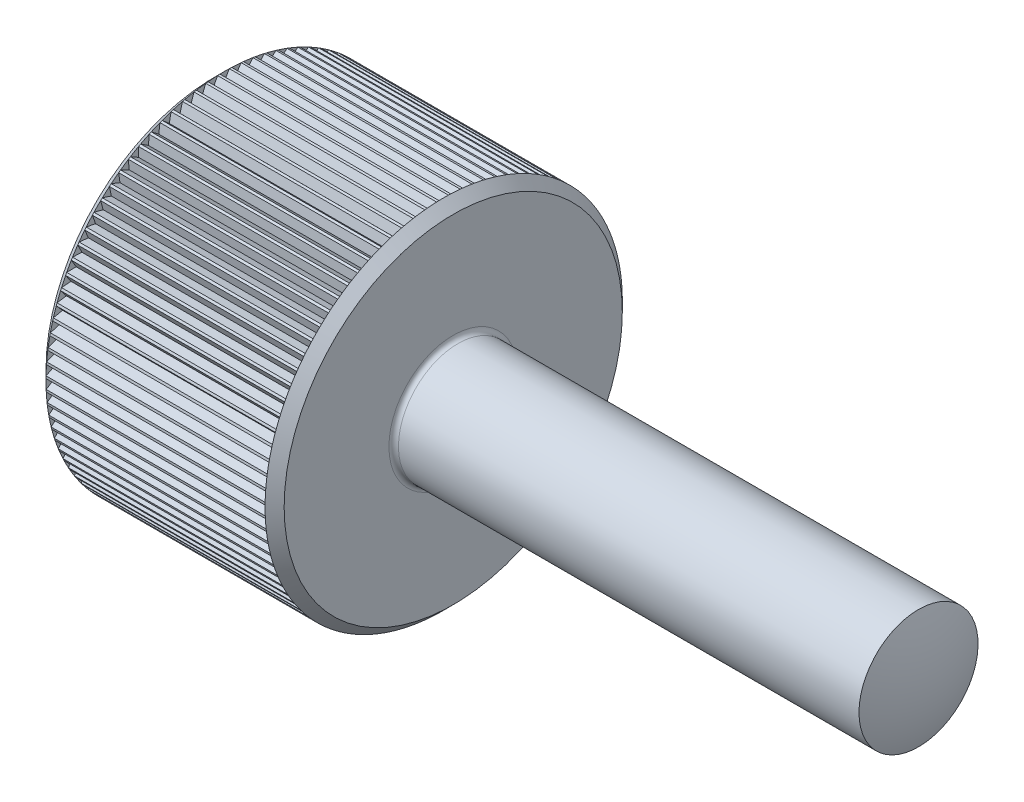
from build123d import *

# Parameters (mm, degrees)
CHAMFER1_SIZE           = 0.8
CUT_EXTRUDE1_DEPTH      = 18.4
CIRCULAR_PATTERN1_COUNT = 95
FILLET1_R               = 0.4


with BuildPart() as part:
    # Sketch1 → Base (revolve)
    with BuildSketch(Plane.XY, mode=Mode.PRIVATE) as base_sk:
        with BuildLine():
            Line((0, 0), (0, 15))
            Line((0, 15), (20, 15))
            Line((20, 15), (20, 5))
            Line((20, 5), (59.076696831, 5))
            ThreePointArc((59.076696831, 5), (59.767239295, 2.542267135), (60, 0))
            Line((60, 0), (0, 0))
        make_face()
    revolve(base_sk.sketch.rotate(Axis((-48.211075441, 0, 0), (1, 0, 0)), 90), axis=Axis((-48.211075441, 0, 0), (1, 0, 0)))

    # Chamfer1
    chamfer1_edges = [part.edges().sort_by_distance(p)[0] for p in [
        (0, 0, -15),
        (20, 0, -15),
    ]]
    chamfer(chamfer1_edges, length=CHAMFER1_SIZE)

    # Sketch3 → Cut-Extrude1 (cut)
    with BuildSketch(Plane(origin=(19.2, 0, 0), x_dir=(0, 0, -1), z_dir=(1, 0, 0))):
        Polygon((0, 14.307179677), (0.6, 15.346410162), (-0.6, 15.346410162), align=None)
    cut_extrude1 = extrude(amount=-CUT_EXTRUDE1_DEPTH, mode=Mode.SUBTRACT)

    # Circular-Pattern1: Cut-Extrude1 ×95 about axis
    circular_pattern1_axis = Axis((0, 0, 0), (1, 0, 0))
    for i in range(1, CIRCULAR_PATTERN1_COUNT):
        add(cut_extrude1.rotate(circular_pattern1_axis, i * 360 / CIRCULAR_PATTERN1_COUNT), mode=Mode.SUBTRACT)

    # Fillet1
    fillet1_edges = [part.edges().sort_by_distance(p)[0] for p in [
        (20, 0, -5),
    ]]
    fillet(fillet1_edges, radius=FILLET1_R)


solid = part.part
